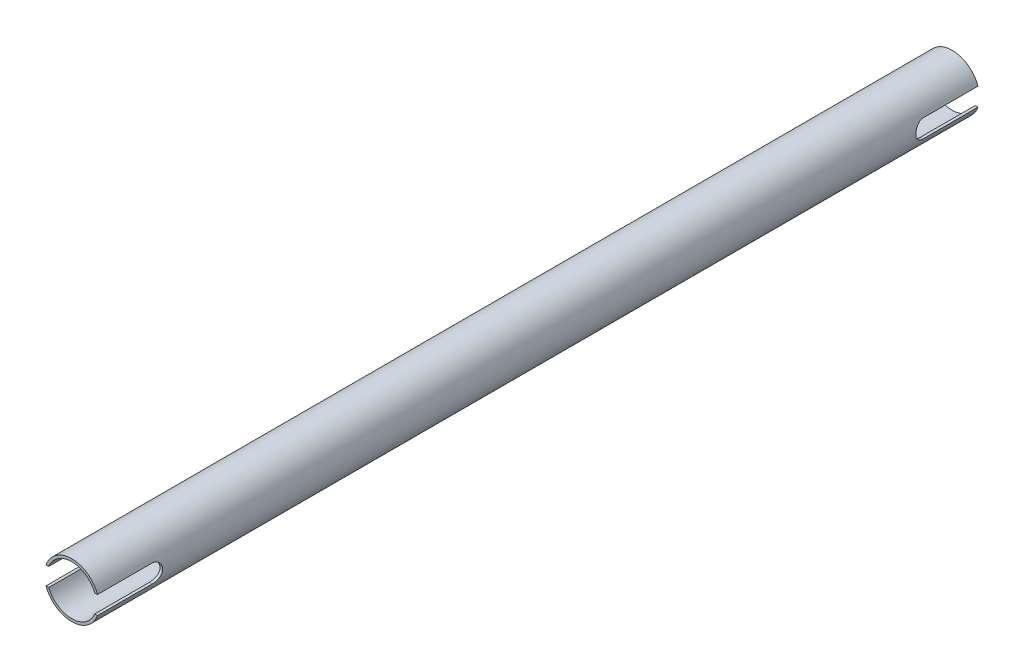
from build123d import *

# Parameters (mm, degrees)
SKETCH1_R           = 9.525
SKETCH1_R_2         = 8.61314
EXTRUDE_THIN1_DEPTH = 153.697183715
CUT_EXTRUDE1_DEPTH  = 155.286342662


with BuildPart() as part:
    # Sketch1 → Extrude-Thin1 (new, symmetric)
    with BuildSketch(Plane.XY):
        Circle(SKETCH1_R)
        Circle(SKETCH1_R_2, mode=Mode.SUBTRACT)
    extrude(amount=EXTRUDE_THIN1_DEPTH, both=True)

    # Sketch2 → Cut-Extrude1 (cut, symmetric)
    with BuildSketch(Plane(origin=(0, 0, 0), x_dir=(0, 0, -1), z_dir=(1, 0, 0))):
        with BuildLine():
            Line((-153.697183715, 3.175), (-153.697183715, -3.175))
            Line((-153.697183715, -3.175), (-134.647183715, -3.175))
            ThreePointArc((-134.647183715, -3.175), (-131.472183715, 0), (-134.647183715, 3.175))
            Line((-134.647183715, 3.175), (-153.697183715, 3.175))
        make_face()
    cut_extrude1 = extrude(amount=CUT_EXTRUDE1_DEPTH, both=True, mode=Mode.SUBTRACT)

    # Mirror1: Cut-Extrude1 across plane
    add(cut_extrude1.mirror(Plane.XY), mode=Mode.SUBTRACT)


solid = part.part
